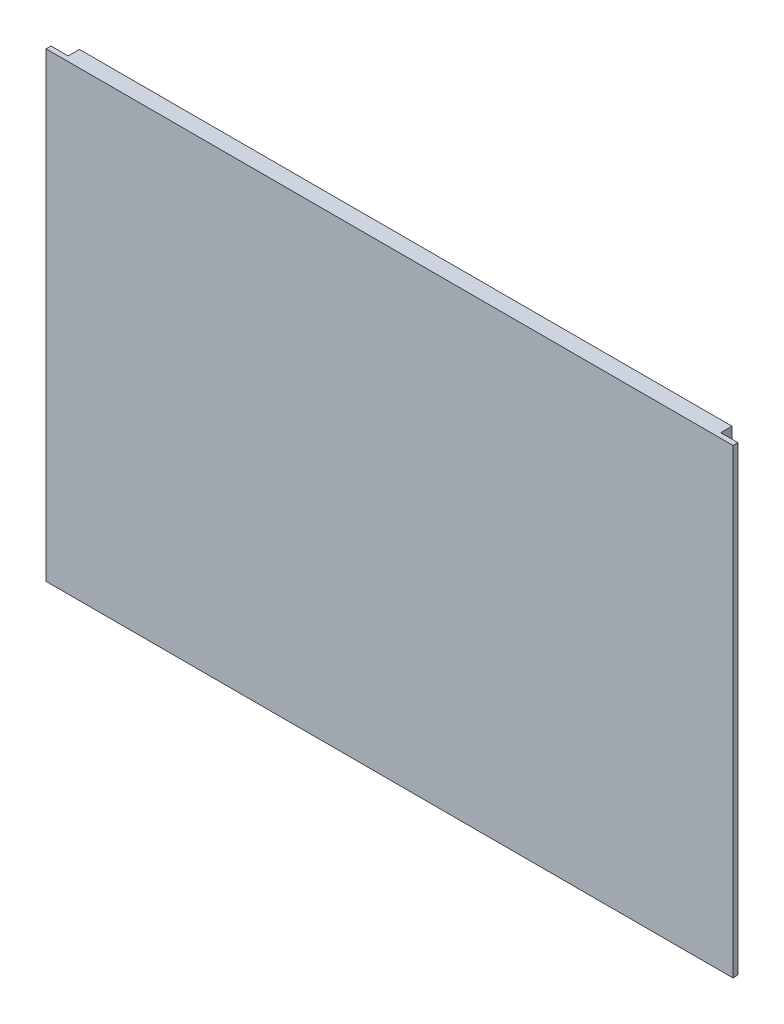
from build123d import *

# Parameters (mm, degrees)
IZIM5_W                     = 140
IZIM5_H                     = 94
Y_KSEKLIK_EKSTR_ZYON5_DEPTH = 1
Y_KSEKLIK_EKSTR_ZYON6_DEPTH = 140
L_O_ALTMA1_COUNT            = 16
L_O_ALTMA1_PITCH            = 6
IZIM11_W                    = 3.3
IZIM11_H                    = 0.9
Y_KSEKLIK_EKSTR_ZYON7_DEPTH = 140
KES_EKSTR_ZYON4_DEPTH       = 140
Y_KSEKLIK_EKSTR_ZYON8_DEPTH = 140
KES_EKSTR_ZYON7_DEPTH       = 3
KES_EKSTR_ZYON9_REACH       = 97.154


with BuildPart() as part:
    # izim5 → Y_kseklik-Ekstr_zyon5 (new body)
    with BuildSketch(Plane.XY):
        with Locations((-8.695652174, -6.130434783)):
            Rectangle(IZIM5_W, IZIM5_H)
    extrude(amount=-Y_KSEKLIK_EKSTR_ZYON5_DEPTH)

    # izim7 → Y_kseklik-Ekstr_zyon6 (add)
    with BuildSketch(Plane.ZY.offset(78.695652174)):
        Polygon((-1, -53.030434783), (-3.3, -52.530434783), (-3.3, -50.030434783), (-1, -49.530434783), align=None)
    y_kseklik_ekstr_zyon6 = extrude(amount=-Y_KSEKLIK_EKSTR_ZYON6_DEPTH)

    # L_o_altma1: Y_kseklik-Ekstr_zyon6 ×16
    with Locations(*[(0, i * L_O_ALTMA1_PITCH, 0) for i in range(1, L_O_ALTMA1_COUNT)]):
        add(y_kseklik_ekstr_zyon6)

    # izim11 → Y_kseklik-Ekstr_zyon7 (add)
    with BuildSketch(Plane.ZY.offset(78.695652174)):
        with Locations((-1.65, 40.419565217)):
            Rectangle(IZIM11_W, IZIM11_H)
    extrude(amount=-Y_KSEKLIK_EKSTR_ZYON7_DEPTH)

    # izim13 → Kes-Ekstr_zyon4 (cut)
    with BuildSketch(Plane.ZY.offset(78.695652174)):
        Polygon((-1, -53.030434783), (1.243008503, -53.409349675), (-0.849031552, -53.522871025), align=None)
    extrude(amount=-KES_EKSTR_ZYON4_DEPTH, mode=Mode.SUBTRACT)


with BuildPart() as kes_ekstr_zyon4_piece_1:
    # of the separate pieces the step leaves, piece 1, a body of its own (kes_ekstr_zyon4_pieces)
    add(part.part.solids().sort_by_distance((-78.695652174, 40.869565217, -3.3))[0])

    # izim14 → Y_kseklik-Ekstr_zyon8 (add)
    with BuildSketch(Plane.ZY.offset(78.695652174)):
        with BuildLine():
            Line((-3.3, 33.969565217), (-7.446751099, 33.969565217))
            add(Edge.make_bspline(
                [(-9.5, 33.469565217), (-8.522252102, 33.926568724), (-7.446751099, 33.969565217)],
                knots=[0, 0, 0, 1, 1, 1], degree=2))
            Line((-9.5, 33.469565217), (-9.5, 32.469565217))
            add(Edge.make_bspline(
                [(-3.3, 31.469565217), (-6.475336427, 31.475292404), (-9.5, 32.469565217)],
                knots=[0, 0, 0, 1, 1, 1], degree=2))
            Line((-3.3, 31.469565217), (-3.3, 33.969565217))
        make_face()
    extrude(amount=-Y_KSEKLIK_EKSTR_ZYON8_DEPTH)

    # izim15 → Kes-Ekstr_zyon7 (cut)
    with BuildSketch(Plane(origin=(0, 33.969565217, 0), x_dir=(1, 0, 0), z_dir=(0, 1, 0))):
        with BuildLine():
            Line((-78.695652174, 3.3), (-74.695652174, 3.3))
            add(Edge.make_bspline(
                [(-74.695652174, 3.3), (-69.575344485, 8.005227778), (-62.695652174, 9.5)],
                knots=[0, 0, 0, 1, 1, 1], degree=2))
            Line((-62.695652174, 9.5), (-78.695652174, 9.5))
            Line((-78.695652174, 9.5), (-78.695652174, 3.3))
        make_face()
        with BuildLine():
            Line((61.304347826, 2.8), (57.304347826, 2.8))
            add(Edge.make_bspline(
                [(57.304347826, 2.8), (52.499558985, 8.164618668), (45.304347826, 9.5)],
                knots=[0, 0, 0, 1, 1, 1], degree=2))
            Line((45.304347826, 9.5), (61.304347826, 9.5))
            Line((61.304347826, 9.5), (61.304347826, 2.8))
        make_face()
    extrude(amount=-KES_EKSTR_ZYON7_DEPTH, mode=Mode.SUBTRACT)

    # Kes-Ekstr_zyon9: up to this face of the body (flat: up to its plane)
    kes_ekstr_zyon9_end = Plane(kes_ekstr_zyon4_piece_1.part.faces().sort_by_distance((-8.695652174, -6.280434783, -1))[0])
    # izim17 → Kes-Ekstr_zyon9 (cut, up to the picked face)
    with BuildSketch(Plane(origin=(0, 0, -3.3), x_dir=(-1, 0, 0), z_dir=(0, 0, -1)), mode=Mode.PRIVATE) as kes_ekstr_zyon9_sk1:
        Polygon((-61.304347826, 40.869565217), (-61.304347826, -53.130434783), (-57.804347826, -53.130434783), (-57.804347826, 44.537071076), (-61.304347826, 44.537071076), align=None)
    kes_ekstr_zyon9_tool1 = split(extrude(kes_ekstr_zyon9_sk1.sketch, amount=-KES_EKSTR_ZYON9_REACH, mode=Mode.PRIVATE), bisect_by=kes_ekstr_zyon9_end, keep=Keep.BOTH, mode=Mode.PRIVATE)
    # izim17 → Kes-Ekstr_zyon9 (cut, up to the picked face)
    with BuildSketch(Plane(origin=(0, 0, -3.3), x_dir=(-1, 0, 0), z_dir=(0, 0, -1)), mode=Mode.PRIVATE) as kes_ekstr_zyon9_sk2:
        Polygon((78.695652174, 44.537071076), (78.695652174, 40.869565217), (78.695652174, -53.130434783), (75.195652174, -53.130434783), (75.195652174, 44.537071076), align=None)
    kes_ekstr_zyon9_tool2 = split(extrude(kes_ekstr_zyon9_sk2.sketch, amount=-KES_EKSTR_ZYON9_REACH, mode=Mode.PRIVATE), bisect_by=kes_ekstr_zyon9_end, keep=Keep.BOTH, mode=Mode.PRIVATE)
    add(kes_ekstr_zyon9_tool1.solids().sort_by(Axis((59.554348, -4.296682, -3.3), (0, 0, 1)))[0], mode=Mode.SUBTRACT)
    add(kes_ekstr_zyon9_tool2.solids().sort_by(Axis((-76.945652, -4.296682, -3.3), (0, 0, 1)))[0], mode=Mode.SUBTRACT)


with BuildPart() as kes_ekstr_zyon4_piece_2:
    # of the separate pieces the step leaves, piece 2, a body of its own (kes_ekstr_zyon4_pieces)
    add(part.part.solids().sort_by_distance((-78.695652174, -53.130434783, -1))[0])


solid = Compound([kes_ekstr_zyon4_piece_1.part, kes_ekstr_zyon4_piece_2.part])
